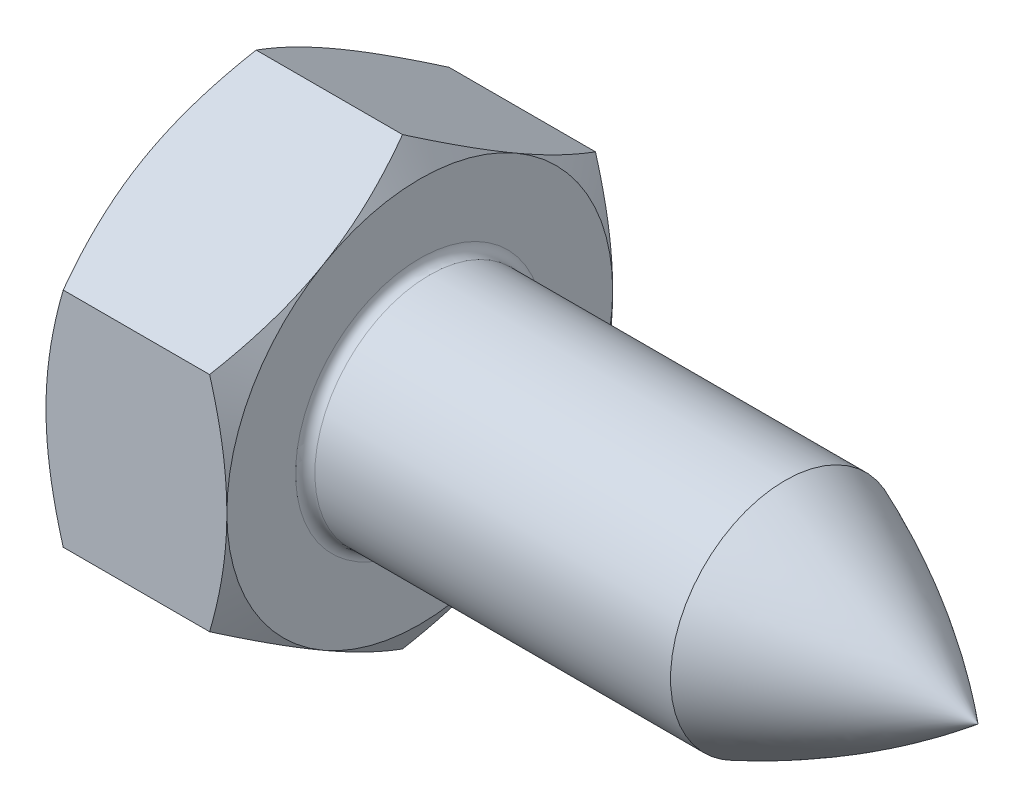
ISO-10303-21;
HEADER;
FILE_DESCRIPTION(('STEP AP214'),'2;1');
FILE_NAME('part.step','',(''),(''),'','','');
FILE_SCHEMA(('AUTOMOTIVE_DESIGN { 1 0 10303 214 1 1 1 1 }'));
ENDSEC;
DATA;
#1=APPLICATION_CONTEXT('core data for automotive mechanical design processes');
#2=APPLICATION_PROTOCOL_DEFINITION('international standard','automotive_design',2000,#1);
#3=PRODUCT_CONTEXT('',#1,'mechanical');
#4=PRODUCT('Part','Part','',(#3));
#5=PRODUCT_RELATED_PRODUCT_CATEGORY('part','',(#4));
#6=PRODUCT_DEFINITION_FORMATION('','',#4);
#7=PRODUCT_DEFINITION_CONTEXT('part definition',#1,'design');
#8=PRODUCT_DEFINITION('design','',#6,#7);
#9=PRODUCT_DEFINITION_SHAPE('','',#8);
#10=(LENGTH_UNIT() NAMED_UNIT(*) SI_UNIT(.MILLI.,.METRE.));
#11=(NAMED_UNIT(*) PLANE_ANGLE_UNIT() SI_UNIT($,.RADIAN.));
#12=(NAMED_UNIT(*) SI_UNIT($,.STERADIAN.) SOLID_ANGLE_UNIT());
#13=UNCERTAINTY_MEASURE_WITH_UNIT(LENGTH_MEASURE(1.E-05),#10,'distance_accuracy_value','');
#14=(GEOMETRIC_REPRESENTATION_CONTEXT(3) GLOBAL_UNCERTAINTY_ASSIGNED_CONTEXT((#13)) GLOBAL_UNIT_ASSIGNED_CONTEXT((#10,
#11,#12)) REPRESENTATION_CONTEXT('',''));
#15=CARTESIAN_POINT('',(0.,0.,0.));
#16=DIRECTION('',(0.,0.,1.));
#17=DIRECTION('',(1.,0.,0.));
#18=AXIS2_PLACEMENT_3D('',#15,#16,#17);
#19=CARTESIAN_POINT('',(-9.54447010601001,0.,0.));
#20=DIRECTION('',(-1.,0.,0.));
#21=DIRECTION('',(0.,0.,1.));
#22=AXIS2_PLACEMENT_3D('',#19,#20,#21);
#23=CYLINDRICAL_SURFACE('',#22,4.75);
#24=CARTESIAN_POINT('',(7.9,0.,0.));
#25=DIRECTION('',(1.,0.,0.));
#26=DIRECTION('',(0.,0.,-1.));
#27=AXIS2_PLACEMENT_3D('',#24,#25,#26);
#28=CIRCLE('',#27,4.75);
#29=CARTESIAN_POINT('',(7.9,0.,-4.75));
#30=VERTEX_POINT('',#29);
#31=EDGE_CURVE('E12',#30,#30,#28,.T.);
#32=ORIENTED_EDGE('',*,*,#31,.T.);
#33=EDGE_LOOP('',(#32));
#34=FACE_BOUND('',#33,.T.);
#35=CARTESIAN_POINT('',(22.65,0.,0.));
#36=DIRECTION('',(1.,0.,0.));
#37=DIRECTION('',(0.,1.,0.));
#38=AXIS2_PLACEMENT_3D('',#35,#36,#37);
#39=CIRCLE('',#38,4.75);
#40=CARTESIAN_POINT('',(22.65,4.75,0.));
#41=VERTEX_POINT('',#40);
#42=EDGE_CURVE('E755',#41,#41,#39,.T.);
#43=ORIENTED_EDGE('',*,*,#42,.F.);
#44=EDGE_LOOP('',(#43));
#45=FACE_BOUND('',#44,.T.);
#46=ADVANCED_FACE('F48',(#34,#45),#23,.T.);
#47=CARTESIAN_POINT('',(1.5,6.66666666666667,0.));
#48=DIRECTION('',(1.,0.,0.));
#49=DIRECTION('',(0.,0.,-1.));
#50=AXIS2_PLACEMENT_3D('',#47,#48,#49);
#51=PLANE('',#50);
#52=CARTESIAN_POINT('',(1.5,0.,0.));
#53=DIRECTION('',(1.,0.,0.));
#54=DIRECTION('',(0.,0.,-1.));
#55=AXIS2_PLACEMENT_3D('',#52,#53,#54);
#56=CIRCLE('',#55,6.66666666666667);
#57=CARTESIAN_POINT('',(1.5,0.,-6.66666666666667));
#58=VERTEX_POINT('',#57);
#59=EDGE_CURVE('E419',#58,#58,#56,.T.);
#60=ORIENTED_EDGE('',*,*,#59,.F.);
#61=EDGE_LOOP('',(#60));
#62=FACE_BOUND('',#61,.T.);
#63=DIRECTION('',(0.,-1.,0.));
#64=VECTOR('',#63,1.);
#65=CARTESIAN_POINT('',(1.5,0.72,-3.6));
#66=LINE('',#65,#64);
#67=CARTESIAN_POINT('',(1.5,0.72,-3.6));
#68=VERTEX_POINT('',#67);
#69=CARTESIAN_POINT('',(1.5,-0.72,-3.6));
#70=VERTEX_POINT('',#69);
#71=EDGE_CURVE('E433',#68,#70,#66,.T.);
#72=ORIENTED_EDGE('',*,*,#71,.F.);
#73=DIRECTION('',(0.,0.,-1.));
#74=VECTOR('',#73,1.);
#75=CARTESIAN_POINT('',(1.5,0.72,-0.72));
#76=LINE('',#75,#74);
#77=CARTESIAN_POINT('',(1.5,0.72,-0.72));
#78=VERTEX_POINT('',#77);
#79=EDGE_CURVE('E435',#78,#68,#76,.T.);
#80=ORIENTED_EDGE('',*,*,#79,.F.);
#81=DIRECTION('',(0.,-1.,0.));
#82=VECTOR('',#81,1.);
#83=CARTESIAN_POINT('',(1.5,3.6,-0.72));
#84=LINE('',#83,#82);
#85=CARTESIAN_POINT('',(1.5,3.6,-0.72));
#86=VERTEX_POINT('',#85);
#87=EDGE_CURVE('E802',#86,#78,#84,.T.);
#88=ORIENTED_EDGE('',*,*,#87,.F.);
#89=DIRECTION('',(0.,0.,-1.));
#90=VECTOR('',#89,1.);
#91=CARTESIAN_POINT('',(1.5,3.6,0.72));
#92=LINE('',#91,#90);
#93=CARTESIAN_POINT('',(1.5,3.6,0.72));
#94=VERTEX_POINT('',#93);
#95=EDGE_CURVE('E805',#94,#86,#92,.T.);
#96=ORIENTED_EDGE('',*,*,#95,.F.);
#97=DIRECTION('',(0.,1.,0.));
#98=VECTOR('',#97,1.);
#99=CARTESIAN_POINT('',(1.5,3.6,0.72));
#100=LINE('',#99,#98);
#101=CARTESIAN_POINT('',(1.5,0.72,0.72));
#102=VERTEX_POINT('',#101);
#103=EDGE_CURVE('E808',#102,#94,#100,.T.);
#104=ORIENTED_EDGE('',*,*,#103,.F.);
#105=DIRECTION('',(0.,0.,-1.));
#106=VECTOR('',#105,1.);
#107=CARTESIAN_POINT('',(1.5,0.72,0.72));
#108=LINE('',#107,#106);
#109=CARTESIAN_POINT('',(1.5,0.72,3.6));
#110=VERTEX_POINT('',#109);
#111=EDGE_CURVE('E818',#110,#102,#108,.T.);
#112=ORIENTED_EDGE('',*,*,#111,.F.);
#113=DIRECTION('',(0.,1.,0.));
#114=VECTOR('',#113,1.);
#115=CARTESIAN_POINT('',(1.5,0.72,3.6));
#116=LINE('',#115,#114);
#117=CARTESIAN_POINT('',(1.5,-0.720000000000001,3.6));
#118=VERTEX_POINT('',#117);
#119=EDGE_CURVE('E822',#118,#110,#116,.T.);
#120=ORIENTED_EDGE('',*,*,#119,.F.);
#121=DIRECTION('',(0.,0.,1.));
#122=VECTOR('',#121,1.);
#123=CARTESIAN_POINT('',(1.5,-0.72,0.72));
#124=LINE('',#123,#122);
#125=CARTESIAN_POINT('',(1.5,-0.72,0.72));
#126=VERTEX_POINT('',#125);
#127=EDGE_CURVE('E425',#126,#118,#124,.T.);
#128=ORIENTED_EDGE('',*,*,#127,.F.);
#129=DIRECTION('',(0.,1.,0.));
#130=VECTOR('',#129,1.);
#131=CARTESIAN_POINT('',(1.5,-3.6,0.72));
#132=LINE('',#131,#130);
#133=CARTESIAN_POINT('',(1.5,-3.6,0.72));
#134=VERTEX_POINT('',#133);
#135=EDGE_CURVE('E422',#134,#126,#132,.T.);
#136=ORIENTED_EDGE('',*,*,#135,.F.);
#137=DIRECTION('',(0.,0.,1.));
#138=VECTOR('',#137,1.);
#139=CARTESIAN_POINT('',(1.5,-3.6,0.72));
#140=LINE('',#139,#138);
#141=CARTESIAN_POINT('',(1.5,-3.6,-0.72));
#142=VERTEX_POINT('',#141);
#143=EDGE_CURVE('E761',#142,#134,#140,.T.);
#144=ORIENTED_EDGE('',*,*,#143,.F.);
#145=DIRECTION('',(0.,-1.,0.));
#146=VECTOR('',#145,1.);
#147=CARTESIAN_POINT('',(1.5,-3.6,-0.72));
#148=LINE('',#147,#146);
#149=CARTESIAN_POINT('',(1.5,-0.72,-0.72));
#150=VERTEX_POINT('',#149);
#151=EDGE_CURVE('E797',#150,#142,#148,.T.);
#152=ORIENTED_EDGE('',*,*,#151,.F.);
#153=DIRECTION('',(0.,0.,1.));
#154=VECTOR('',#153,1.);
#155=CARTESIAN_POINT('',(1.5,-0.72,-0.72));
#156=LINE('',#155,#154);
#157=EDGE_CURVE('E436',#70,#150,#156,.T.);
#158=ORIENTED_EDGE('',*,*,#157,.F.);
#159=EDGE_LOOP('',(#72,#80,#88,#96,#104,#112,#120,#128,#136,#144,#152,#158));
#160=FACE_BOUND('',#159,.T.);
#161=ADVANCED_FACE('F190',(#62,#160),#51,.F.);
#162=CARTESIAN_POINT('',(7.5,13.856406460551,8.));
#163=DIRECTION('',(1.,0.,0.));
#164=DIRECTION('',(0.,0.,-1.));
#165=AXIS2_PLACEMENT_3D('',#162,#163,#164);
#166=PLANE('',#165);
#167=CARTESIAN_POINT('',(7.5,0.,0.));
#168=DIRECTION('',(1.,0.,0.));
#169=DIRECTION('',(0.,0.,-1.));
#170=AXIS2_PLACEMENT_3D('',#167,#168,#169);
#171=CIRCLE('',#170,5.15);
#172=CARTESIAN_POINT('',(7.5,0.,-5.15));
#173=VERTEX_POINT('',#172);
#174=EDGE_CURVE('E56',#173,#173,#171,.F.);
#175=ORIENTED_EDGE('',*,*,#174,.T.);
#176=EDGE_LOOP('',(#175));
#177=FACE_BOUND('',#176,.T.);
#178=CARTESIAN_POINT('',(7.5,0.,0.));
#179=DIRECTION('',(1.,0.,0.));
#180=DIRECTION('',(0.,1.,0.));
#181=AXIS2_PLACEMENT_3D('',#178,#179,#180);
#182=CIRCLE('',#181,8.);
#183=CARTESIAN_POINT('',(7.5,-6.92820323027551,-4.));
#184=VERTEX_POINT('',#183);
#185=CARTESIAN_POINT('',(7.5,0.,-8.));
#186=VERTEX_POINT('',#185);
#187=EDGE_CURVE('E417',#184,#186,#182,.T.);
#188=ORIENTED_EDGE('',*,*,#187,.T.);
#189=CARTESIAN_POINT('',(7.5,6.92820323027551,-4.));
#190=VERTEX_POINT('',#189);
#191=EDGE_CURVE('E414',#186,#190,#182,.T.);
#192=ORIENTED_EDGE('',*,*,#191,.T.);
#193=CARTESIAN_POINT('',(7.5,6.92820323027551,4.));
#194=VERTEX_POINT('',#193);
#195=EDGE_CURVE('E409',#190,#194,#182,.T.);
#196=ORIENTED_EDGE('',*,*,#195,.T.);
#197=CARTESIAN_POINT('',(7.5,0.,8.));
#198=VERTEX_POINT('',#197);
#199=EDGE_CURVE('E71',#194,#198,#182,.T.);
#200=ORIENTED_EDGE('',*,*,#199,.T.);
#201=CARTESIAN_POINT('',(7.5,-6.92820323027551,4.));
#202=VERTEX_POINT('',#201);
#203=EDGE_CURVE('E408',#198,#202,#182,.T.);
#204=ORIENTED_EDGE('',*,*,#203,.T.);
#205=EDGE_CURVE('E412',#202,#184,#182,.T.);
#206=ORIENTED_EDGE('',*,*,#205,.T.);
#207=EDGE_LOOP('',(#188,#192,#196,#200,#204,#206));
#208=FACE_BOUND('',#207,.T.);
#209=ADVANCED_FACE('F196',(#177,#208),#166,.T.);
#210=CARTESIAN_POINT('',(6.78546882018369,0.,0.));
#211=DIRECTION('',(-1.,0.,0.));
#212=DIRECTION('',(0.,-1.,0.));
#213=AXIS2_PLACEMENT_3D('',#210,#211,#212);
#214=CONICAL_SURFACE('',#213,9.23760430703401,1.0471975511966);
#215=CARTESIAN_POINT('',(3.67178635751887,-12.2497439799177,-8.));
#216=CARTESIAN_POINT('',(3.84152745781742,-11.8984987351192,-8.));
#217=CARTESIAN_POINT('',(4.00958119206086,-11.5464230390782,-8.));
#218=CARTESIAN_POINT('',(4.34134970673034,-10.8401616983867,-8.));
#219=CARTESIAN_POINT('',(4.5050637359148,-10.4859757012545,-8.));
#220=CARTESIAN_POINT('',(4.82805107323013,-9.7731314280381,-8.));
#221=CARTESIAN_POINT('',(4.98729360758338,-9.41445915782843,-8.));
#222=CARTESIAN_POINT('',(5.29893883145,-8.69416671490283,-8.));
#223=CARTESIAN_POINT('',(5.45134187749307,-8.33254669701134,-8.));
#224=CARTESIAN_POINT('',(5.74929869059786,-7.60129405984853,-8.));
#225=CARTESIAN_POINT('',(5.89474539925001,-7.23161757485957,-8.));
#226=CARTESIAN_POINT('',(6.1742475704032,-6.48790521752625,-8.));
#227=CARTESIAN_POINT('',(6.3083017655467,-6.11386886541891,-8.));
#228=CARTESIAN_POINT('',(6.56141638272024,-5.36160531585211,-8.));
#229=CARTESIAN_POINT('',(6.68050868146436,-4.98338896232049,-8.));
#230=CARTESIAN_POINT('',(6.89983373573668,-4.22159300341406,-8.));
#231=CARTESIAN_POINT('',(7.00007245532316,-3.83801513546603,-8.));
#232=CARTESIAN_POINT('',(7.17681673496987,-3.06517005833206,-8.));
#233=CARTESIAN_POINT('',(7.25331597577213,-2.67590136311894,-8.));
#234=CARTESIAN_POINT('',(7.34642984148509,-2.0885729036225,-8.));
#235=CARTESIAN_POINT('',(7.37386398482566,-1.89220175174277,-8.));
#236=CARTESIAN_POINT('',(7.42098081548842,-1.49853877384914,-8.));
#237=CARTESIAN_POINT('',(7.44066427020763,-1.30124704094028,-8.));
#238=CARTESIAN_POINT('',(7.47175001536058,-0.907261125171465,-8.));
#239=CARTESIAN_POINT('',(7.48320372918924,-0.710571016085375,-8.));
#240=CARTESIAN_POINT('',(7.49776943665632,-0.316882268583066,-8.));
#241=CARTESIAN_POINT('',(7.50088153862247,-0.11988363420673,-8.));
#242=CARTESIAN_POINT('',(7.49868986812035,0.274012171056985,-8.));
#243=CARTESIAN_POINT('',(7.49338845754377,0.47090935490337,-8.));
#244=CARTESIAN_POINT('',(7.47450159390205,0.864308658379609,-8.));
#245=CARTESIAN_POINT('',(7.46091572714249,1.06081075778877,-8.));
#246=CARTESIAN_POINT('',(7.41823147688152,1.53707134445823,-8.));
#247=CARTESIAN_POINT('',(7.38498228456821,1.81646391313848,-8.));
#248=CARTESIAN_POINT('',(7.30358169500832,2.37310809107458,-8.));
#249=CARTESIAN_POINT('',(7.25542623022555,2.6503590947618,-8.));
#250=CARTESIAN_POINT('',(7.14592101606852,3.20249141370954,-8.));
#251=CARTESIAN_POINT('',(7.08455879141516,3.47737023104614,-8.));
#252=CARTESIAN_POINT('',(6.95051229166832,4.02429975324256,-8.));
#253=CARTESIAN_POINT('',(6.87782908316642,4.29635072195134,-8.));
#254=CARTESIAN_POINT('',(6.72097954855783,4.84432510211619,-8.));
#255=CARTESIAN_POINT('',(6.63657541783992,5.12017997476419,-8.));
#256=CARTESIAN_POINT('',(6.4594275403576,5.6689739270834,-8.));
#257=CARTESIAN_POINT('',(6.36668954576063,5.94191487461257,-8.));
#258=CARTESIAN_POINT('',(6.17478953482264,6.48378576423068,-8.));
#259=CARTESIAN_POINT('',(6.07566661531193,6.75272963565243,-8.));
#260=CARTESIAN_POINT('',(5.87160282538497,7.2885307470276,-8.));
#261=CARTESIAN_POINT('',(5.76665960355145,7.55538709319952,-8.));
#262=CARTESIAN_POINT('',(5.65938198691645,7.82127397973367,-8.));
#263=B_SPLINE_CURVE_WITH_KNOTS('',3,(#215,#216,#217,#218,#219,#220,#221,#222,#223,#224,#225,
#226,#227,#228,#229,#230,#231,#232,#233,#234,#235,#236,#237,#238,#239,#240,#241,#242,#243,#244,
#245,#246,#247,#248,#249,#250,#251,#252,#253,#254,#255,#256,#257,#258,#259,#260,#261,#262),
.UNSPECIFIED.,.F.,.F.,(4,2,2,2,2,2,2,2,2,2,2,2,2,2,2,2,2,2,2,2,2,2,2,4),(0.,1.17034358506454,
2.3408884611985,3.51813189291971,4.69531388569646,5.88694801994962,7.07871454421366,
8.26789729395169,9.45670322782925,10.6458253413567,11.2405311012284,11.8351779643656,
12.4260760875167,13.0169665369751,13.6076911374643,14.1984452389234,15.0420672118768,
15.8859195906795,16.7305726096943,17.5751460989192,18.4404219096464,19.305105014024,
20.1649211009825,21.0250871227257),.UNSPECIFIED.);
#264=CARTESIAN_POINT('',(6.78546882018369,-4.61880215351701,-8.));
#265=VERTEX_POINT('',#264);
#266=EDGE_CURVE('E233',#186,#265,#263,.F.);
#267=ORIENTED_EDGE('',*,*,#266,.F.);
#268=ORIENTED_EDGE('',*,*,#187,.F.);
#269=CARTESIAN_POINT('',(6.78540215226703,-4.61868668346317,-8.0002));
#270=CARTESIAN_POINT('',(6.84400928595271,-4.7202130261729,-7.8243512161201));
#271=CARTESIAN_POINT('',(6.89995659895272,-4.82211789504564,-7.64784680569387));
#272=CARTESIAN_POINT('',(7.00579899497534,-5.02675523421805,-7.29340453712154));
#273=CARTESIAN_POINT('',(7.05569146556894,-5.12948804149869,-7.11546609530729));
#274=CARTESIAN_POINT('',(7.19530720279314,-5.43933133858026,-6.57880176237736));
#275=CARTESIAN_POINT('',(7.27471882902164,-5.64766491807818,-6.21795741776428));
#276=CARTESIAN_POINT('',(7.36783835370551,-5.95943209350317,-5.67796082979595));
#277=CARTESIAN_POINT('',(7.39436541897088,-6.06193429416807,-5.50042181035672));
#278=CARTESIAN_POINT('',(7.43884682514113,-6.26740224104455,-5.1445408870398));
#279=CARTESIAN_POINT('',(7.45680192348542,-6.37036794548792,-4.96619905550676));
#280=CARTESIAN_POINT('',(7.48368435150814,-6.57647664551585,-4.60920831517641));
#281=CARTESIAN_POINT('',(7.49262192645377,-6.67961930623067,-4.4305599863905));
#282=CARTESIAN_POINT('',(7.50127769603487,-6.88599991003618,-4.07309829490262));
#283=CARTESIAN_POINT('',(7.50099617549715,-6.98923785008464,-3.89428493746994));
#284=CARTESIAN_POINT('',(7.49185497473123,-7.18224506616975,-3.5599866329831));
#285=CARTESIAN_POINT('',(7.48411039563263,-7.27202796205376,-3.40447809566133));
#286=CARTESIAN_POINT('',(7.46179886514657,-7.45138347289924,-3.09382523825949));
#287=CARTESIAN_POINT('',(7.44723145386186,-7.5409560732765,-2.93868094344));
#288=CARTESIAN_POINT('',(7.39363930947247,-7.80932710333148,-2.47384868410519));
#289=CARTESIAN_POINT('',(7.34473135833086,-7.98765049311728,-2.16498351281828));
#290=CARTESIAN_POINT('',(7.22246059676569,-8.34618890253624,-1.5439767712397));
#291=CARTESIAN_POINT('',(7.14857947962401,-8.52635816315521,-1.23191445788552));
#292=CARTESIAN_POINT('',(6.98089985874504,-8.88400987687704,-0.612443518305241));
#293=CARTESIAN_POINT('',(6.88714073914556,-9.06149691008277,-0.305026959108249));
#294=CARTESIAN_POINT('',(6.78540215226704,-9.23771977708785,0.000200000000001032));
#295=B_SPLINE_CURVE_WITH_KNOTS('',3,(#269,#270,#271,#272,#273,#274,#275,#276,#277,#278,#279,
#280,#281,#282,#283,#284,#285,#286,#287,#288,#289,#290,#291,#292,#293,#294),.UNSPECIFIED.,.F.,
.F.,(4,2,2,2,2,2,2,2,2,2,2,2,4),(0.,0.633973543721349,1.26821965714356,2.53934712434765,
3.15934343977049,3.77928496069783,4.39852133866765,5.01773858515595,5.55680239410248,
6.09590254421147,7.17487077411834,8.27776850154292,9.37850115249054),.UNSPECIFIED.);
#296=EDGE_CURVE('E260',#265,#184,#295,.T.);
#297=ORIENTED_EDGE('',*,*,#296,.F.);
#298=EDGE_LOOP('',(#267,#268,#297));
#299=FACE_BOUND('',#298,.T.);
#300=ADVANCED_FACE('F207',(#299),#214,.T.);
#301=ORIENTED_EDGE('',*,*,#191,.F.);
#302=CARTESIAN_POINT('',(6.78546882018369,4.618802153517,-8.));
#303=VERTEX_POINT('',#302);
#304=EDGE_CURVE('E240',#303,#186,#263,.F.);
#305=ORIENTED_EDGE('',*,*,#304,.F.);
#306=CARTESIAN_POINT('',(6.78540215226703,9.23771977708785,0.000200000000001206));
#307=CARTESIAN_POINT('',(6.84400928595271,9.13619343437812,-0.175648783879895));
#308=CARTESIAN_POINT('',(6.89995659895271,9.03428856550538,-0.352153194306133));
#309=CARTESIAN_POINT('',(7.00579899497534,8.82965122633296,-0.706595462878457));
#310=CARTESIAN_POINT('',(7.05569146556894,8.72691841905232,-0.884533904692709));
#311=CARTESIAN_POINT('',(7.19530720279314,8.41707512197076,-1.42119823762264));
#312=CARTESIAN_POINT('',(7.27471882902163,8.20874154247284,-1.78204258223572));
#313=CARTESIAN_POINT('',(7.36783835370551,7.89697436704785,-2.32203917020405));
#314=CARTESIAN_POINT('',(7.39436541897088,7.79447216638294,-2.49957818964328));
#315=CARTESIAN_POINT('',(7.43884682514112,7.58900421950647,-2.8554591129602));
#316=CARTESIAN_POINT('',(7.45680192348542,7.4860385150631,-3.03380094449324));
#317=CARTESIAN_POINT('',(7.48368435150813,7.27992981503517,-3.39079168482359));
#318=CARTESIAN_POINT('',(7.49262192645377,7.17678715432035,-3.5694400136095));
#319=CARTESIAN_POINT('',(7.50127769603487,6.97040655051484,-3.92690170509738));
#320=CARTESIAN_POINT('',(7.50099617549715,6.86716861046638,-4.10571506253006));
#321=CARTESIAN_POINT('',(7.49185497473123,6.67416139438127,-4.4400133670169));
#322=CARTESIAN_POINT('',(7.48411039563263,6.58437849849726,-4.59552190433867));
#323=CARTESIAN_POINT('',(7.46179886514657,6.40502298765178,-4.90617476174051));
#324=CARTESIAN_POINT('',(7.44723145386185,6.31545038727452,-5.06131905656));
#325=CARTESIAN_POINT('',(7.39363930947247,6.04707935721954,-5.52615131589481));
#326=CARTESIAN_POINT('',(7.34473135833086,5.86875596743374,-5.83501648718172));
#327=CARTESIAN_POINT('',(7.22246059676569,5.51021755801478,-6.4560232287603));
#328=CARTESIAN_POINT('',(7.14857947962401,5.3300482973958,-6.76808554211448));
#329=CARTESIAN_POINT('',(6.98089985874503,4.97239658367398,-7.38755648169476));
#330=CARTESIAN_POINT('',(6.88714073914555,4.79490955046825,-7.69497304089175));
#331=CARTESIAN_POINT('',(6.78540215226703,4.61868668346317,-8.0002));
#332=B_SPLINE_CURVE_WITH_KNOTS('',3,(#306,#307,#308,#309,#310,#311,#312,#313,#314,#315,#316,
#317,#318,#319,#320,#321,#322,#323,#324,#325,#326,#327,#328,#329,#330,#331),.UNSPECIFIED.,.F.,
.F.,(4,2,2,2,2,2,2,2,2,2,2,2,4),(0.,0.633973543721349,1.26821965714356,2.53934712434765,
3.15934343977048,3.77928496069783,4.39852133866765,5.01773858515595,5.55680239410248,
6.09590254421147,7.17487077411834,8.27776850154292,9.37850115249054),.UNSPECIFIED.);
#333=EDGE_CURVE('E267',#190,#303,#332,.T.);
#334=ORIENTED_EDGE('',*,*,#333,.F.);
#335=EDGE_LOOP('',(#301,#305,#334));
#336=FACE_BOUND('',#335,.T.);
#337=ADVANCED_FACE('F689',(#336),#214,.T.);
#338=CARTESIAN_POINT('',(6.78546882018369,-9.23760430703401,0.));
#339=VERTEX_POINT('',#338);
#340=EDGE_CURVE('E392',#184,#339,#295,.T.);
#341=ORIENTED_EDGE('',*,*,#340,.F.);
#342=ORIENTED_EDGE('',*,*,#205,.F.);
#343=CARTESIAN_POINT('',(6.78540215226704,-9.23771977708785,-0.000199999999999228));
#344=CARTESIAN_POINT('',(6.84400928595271,-9.13619343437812,0.175648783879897));
#345=CARTESIAN_POINT('',(6.89995659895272,-9.03428856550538,0.352153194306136));
#346=CARTESIAN_POINT('',(7.00579899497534,-8.82965122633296,0.706595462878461));
#347=CARTESIAN_POINT('',(7.05569146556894,-8.72691841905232,0.884533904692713));
#348=CARTESIAN_POINT('',(7.19530720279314,-8.41707512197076,1.42119823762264));
#349=CARTESIAN_POINT('',(7.27471882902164,-8.20874154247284,1.78204258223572));
#350=CARTESIAN_POINT('',(7.36783835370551,-7.89697436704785,2.32203917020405));
#351=CARTESIAN_POINT('',(7.39436541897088,-7.79447216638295,2.49957818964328));
#352=CARTESIAN_POINT('',(7.43884682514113,-7.58900421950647,2.8554591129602));
#353=CARTESIAN_POINT('',(7.45680192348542,-7.4860385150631,3.03380094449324));
#354=CARTESIAN_POINT('',(7.48368435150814,-7.27992981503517,3.39079168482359));
#355=CARTESIAN_POINT('',(7.49262192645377,-7.17678715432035,3.5694400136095));
#356=CARTESIAN_POINT('',(7.50127769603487,-6.97040655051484,3.92690170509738));
#357=CARTESIAN_POINT('',(7.50099617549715,-6.86716861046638,4.10571506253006));
#358=CARTESIAN_POINT('',(7.49185497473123,-6.67416139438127,4.4400133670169));
#359=CARTESIAN_POINT('',(7.48411039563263,-6.58437849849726,4.59552190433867));
#360=CARTESIAN_POINT('',(7.46179886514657,-6.40502298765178,4.90617476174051));
#361=CARTESIAN_POINT('',(7.44723145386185,-6.31545038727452,5.06131905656));
#362=CARTESIAN_POINT('',(7.39363930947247,-6.04707935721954,5.52615131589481));
#363=CARTESIAN_POINT('',(7.34473135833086,-5.86875596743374,5.83501648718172));
#364=CARTESIAN_POINT('',(7.22246059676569,-5.51021755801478,6.4560232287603));
#365=CARTESIAN_POINT('',(7.14857947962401,-5.33004829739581,6.76808554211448));
#366=CARTESIAN_POINT('',(6.98089985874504,-4.97239658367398,7.38755648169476));
#367=CARTESIAN_POINT('',(6.88714073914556,-4.79490955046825,7.69497304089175));
#368=CARTESIAN_POINT('',(6.78540215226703,-4.61868668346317,8.0002));
#369=B_SPLINE_CURVE_WITH_KNOTS('',3,(#343,#344,#345,#346,#347,#348,#349,#350,#351,#352,#353,
#354,#355,#356,#357,#358,#359,#360,#361,#362,#363,#364,#365,#366,#367,#368),.UNSPECIFIED.,.F.,
.F.,(4,2,2,2,2,2,2,2,2,2,2,2,4),(0.,0.63397354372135,1.26821965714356,2.53934712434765,
3.15934343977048,3.77928496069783,4.39852133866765,5.01773858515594,5.55680239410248,
6.09590254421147,7.17487077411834,8.27776850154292,9.37850115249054),.UNSPECIFIED.);
#370=EDGE_CURVE('E272',#339,#202,#369,.T.);
#371=ORIENTED_EDGE('',*,*,#370,.F.);
#372=EDGE_LOOP('',(#341,#342,#371));
#373=FACE_BOUND('',#372,.T.);
#374=ADVANCED_FACE('F250',(#373),#214,.T.);
#375=CARTESIAN_POINT('',(6.78546882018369,-4.61880215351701,7.99999999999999));
#376=VERTEX_POINT('',#375);
#377=EDGE_CURVE('E402',#202,#376,#369,.T.);
#378=ORIENTED_EDGE('',*,*,#377,.F.);
#379=ORIENTED_EDGE('',*,*,#203,.F.);
#380=CARTESIAN_POINT('',(3.67178635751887,-12.2497439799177,8.));
#381=CARTESIAN_POINT('',(3.84152745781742,-11.8984987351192,8.));
#382=CARTESIAN_POINT('',(4.00958119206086,-11.5464230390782,8.));
#383=CARTESIAN_POINT('',(4.34134970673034,-10.8401616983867,8.));
#384=CARTESIAN_POINT('',(4.5050637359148,-10.4859757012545,8.));
#385=CARTESIAN_POINT('',(4.82805107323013,-9.7731314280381,8.));
#386=CARTESIAN_POINT('',(4.98729360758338,-9.41445915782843,8.));
#387=CARTESIAN_POINT('',(5.29893883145,-8.69416671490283,8.));
#388=CARTESIAN_POINT('',(5.45134187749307,-8.33254669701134,8.));
#389=CARTESIAN_POINT('',(5.74929869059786,-7.60129405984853,8.));
#390=CARTESIAN_POINT('',(5.89474539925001,-7.23161757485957,8.));
#391=CARTESIAN_POINT('',(6.1742475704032,-6.48790521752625,8.));
#392=CARTESIAN_POINT('',(6.3083017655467,-6.11386886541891,8.));
#393=CARTESIAN_POINT('',(6.56141638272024,-5.36160531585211,8.));
#394=CARTESIAN_POINT('',(6.68050868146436,-4.98338896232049,8.));
#395=CARTESIAN_POINT('',(6.89983373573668,-4.22159300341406,8.));
#396=CARTESIAN_POINT('',(7.00007245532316,-3.83801513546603,8.));
#397=CARTESIAN_POINT('',(7.17681673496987,-3.06517005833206,8.));
#398=CARTESIAN_POINT('',(7.25331597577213,-2.67590136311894,8.));
#399=CARTESIAN_POINT('',(7.34642984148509,-2.0885729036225,8.));
#400=CARTESIAN_POINT('',(7.37386398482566,-1.89220175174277,8.));
#401=CARTESIAN_POINT('',(7.42098081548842,-1.49853877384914,8.));
#402=CARTESIAN_POINT('',(7.44066427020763,-1.30124704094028,8.));
#403=CARTESIAN_POINT('',(7.47175001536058,-0.907261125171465,8.));
#404=CARTESIAN_POINT('',(7.48320372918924,-0.710571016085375,8.));
#405=CARTESIAN_POINT('',(7.49776943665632,-0.316882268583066,8.));
#406=CARTESIAN_POINT('',(7.50088153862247,-0.11988363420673,8.));
#407=CARTESIAN_POINT('',(7.49868986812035,0.274012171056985,8.));
#408=CARTESIAN_POINT('',(7.49338845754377,0.47090935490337,8.));
#409=CARTESIAN_POINT('',(7.47450159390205,0.864308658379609,8.));
#410=CARTESIAN_POINT('',(7.46091572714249,1.06081075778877,8.));
#411=CARTESIAN_POINT('',(7.41823147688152,1.53707134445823,8.));
#412=CARTESIAN_POINT('',(7.38498228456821,1.81646391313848,8.));
#413=CARTESIAN_POINT('',(7.30358169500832,2.37310809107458,8.));
#414=CARTESIAN_POINT('',(7.25542623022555,2.6503590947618,8.));
#415=CARTESIAN_POINT('',(7.14592101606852,3.20249141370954,8.));
#416=CARTESIAN_POINT('',(7.08455879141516,3.47737023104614,8.));
#417=CARTESIAN_POINT('',(6.95051229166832,4.02429975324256,8.));
#418=CARTESIAN_POINT('',(6.87782908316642,4.29635072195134,8.));
#419=CARTESIAN_POINT('',(6.72097954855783,4.84432510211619,8.));
#420=CARTESIAN_POINT('',(6.63657541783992,5.12017997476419,8.));
#421=CARTESIAN_POINT('',(6.4594275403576,5.6689739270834,8.));
#422=CARTESIAN_POINT('',(6.36668954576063,5.94191487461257,8.));
#423=CARTESIAN_POINT('',(6.17478953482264,6.48378576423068,8.));
#424=CARTESIAN_POINT('',(6.07566661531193,6.75272963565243,8.));
#425=CARTESIAN_POINT('',(5.87160282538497,7.2885307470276,8.));
#426=CARTESIAN_POINT('',(5.76665960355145,7.55538709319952,8.));
#427=CARTESIAN_POINT('',(5.65938198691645,7.82127397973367,8.));
#428=B_SPLINE_CURVE_WITH_KNOTS('',3,(#380,#381,#382,#383,#384,#385,#386,#387,#388,#389,#390,
#391,#392,#393,#394,#395,#396,#397,#398,#399,#400,#401,#402,#403,#404,#405,#406,#407,#408,#409,
#410,#411,#412,#413,#414,#415,#416,#417,#418,#419,#420,#421,#422,#423,#424,#425,#426,#427),
.UNSPECIFIED.,.F.,.F.,(4,2,2,2,2,2,2,2,2,2,2,2,2,2,2,2,2,2,2,2,2,2,2,4),(0.,1.17034358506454,
2.3408884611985,3.51813189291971,4.69531388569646,5.88694801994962,7.07871454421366,
8.26789729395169,9.45670322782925,10.6458253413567,11.2405311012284,11.8351779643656,
12.4260760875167,13.0169665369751,13.6076911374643,14.1984452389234,15.0420672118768,
15.8859195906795,16.7305726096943,17.5751460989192,18.4404219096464,19.305105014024,
20.1649211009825,21.0250871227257),.UNSPECIFIED.);
#429=EDGE_CURVE('E400',#376,#198,#428,.T.);
#430=ORIENTED_EDGE('',*,*,#429,.F.);
#431=EDGE_LOOP('',(#378,#379,#430));
#432=FACE_BOUND('',#431,.T.);
#433=ADVANCED_FACE('F246',(#432),#214,.T.);
#434=ORIENTED_EDGE('',*,*,#199,.F.);
#435=CARTESIAN_POINT('',(6.78540215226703,4.61868668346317,8.0002));
#436=CARTESIAN_POINT('',(6.84400928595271,4.72021302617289,7.8243512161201));
#437=CARTESIAN_POINT('',(6.89995659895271,4.82211789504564,7.64784680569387));
#438=CARTESIAN_POINT('',(7.00579899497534,5.02675523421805,7.29340453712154));
#439=CARTESIAN_POINT('',(7.05569146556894,5.12948804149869,7.11546609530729));
#440=CARTESIAN_POINT('',(7.19530720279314,5.43933133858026,6.57880176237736));
#441=CARTESIAN_POINT('',(7.27471882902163,5.64766491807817,6.21795741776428));
#442=CARTESIAN_POINT('',(7.36783835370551,5.95943209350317,5.67796082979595));
#443=CARTESIAN_POINT('',(7.39436541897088,6.06193429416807,5.50042181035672));
#444=CARTESIAN_POINT('',(7.43884682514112,6.26740224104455,5.1445408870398));
#445=CARTESIAN_POINT('',(7.45680192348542,6.37036794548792,4.96619905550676));
#446=CARTESIAN_POINT('',(7.48368435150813,6.57647664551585,4.60920831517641));
#447=CARTESIAN_POINT('',(7.49262192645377,6.67961930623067,4.4305599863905));
#448=CARTESIAN_POINT('',(7.50127769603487,6.88599991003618,4.07309829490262));
#449=CARTESIAN_POINT('',(7.50099617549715,6.98923785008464,3.89428493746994));
#450=CARTESIAN_POINT('',(7.49185497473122,7.18224506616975,3.5599866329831));
#451=CARTESIAN_POINT('',(7.48411039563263,7.27202796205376,3.40447809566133));
#452=CARTESIAN_POINT('',(7.46179886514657,7.45138347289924,3.09382523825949));
#453=CARTESIAN_POINT('',(7.44723145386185,7.5409560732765,2.93868094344));
#454=CARTESIAN_POINT('',(7.39363930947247,7.80932710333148,2.47384868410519));
#455=CARTESIAN_POINT('',(7.34473135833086,7.98765049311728,2.16498351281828));
#456=CARTESIAN_POINT('',(7.22246059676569,8.34618890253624,1.5439767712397));
#457=CARTESIAN_POINT('',(7.14857947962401,8.52635816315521,1.23191445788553));
#458=CARTESIAN_POINT('',(6.98089985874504,8.88400987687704,0.612443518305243));
#459=CARTESIAN_POINT('',(6.88714073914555,9.06149691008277,0.30502695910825));
#460=CARTESIAN_POINT('',(6.78540215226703,9.23771977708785,-0.000199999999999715));
#461=B_SPLINE_CURVE_WITH_KNOTS('',3,(#435,#436,#437,#438,#439,#440,#441,#442,#443,#444,#445,
#446,#447,#448,#449,#450,#451,#452,#453,#454,#455,#456,#457,#458,#459,#460),.UNSPECIFIED.,.F.,
.F.,(4,2,2,2,2,2,2,2,2,2,2,2,4),(0.,0.633973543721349,1.26821965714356,2.53934712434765,
3.15934343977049,3.77928496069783,4.39852133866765,5.01773858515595,5.55680239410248,
6.09590254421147,7.17487077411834,8.27776850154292,9.37850115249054),.UNSPECIFIED.);
#462=CARTESIAN_POINT('',(6.78546882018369,4.618802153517,8.));
#463=VERTEX_POINT('',#462);
#464=EDGE_CURVE('E283',#463,#194,#461,.T.);
#465=ORIENTED_EDGE('',*,*,#464,.F.);
#466=EDGE_CURVE('E284',#198,#463,#428,.T.);
#467=ORIENTED_EDGE('',*,*,#466,.F.);
#468=EDGE_LOOP('',(#434,#465,#467));
#469=FACE_BOUND('',#468,.T.);
#470=ADVANCED_FACE('F249',(#469),#214,.T.);
#471=ORIENTED_EDGE('',*,*,#195,.F.);
#472=CARTESIAN_POINT('',(6.78546882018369,9.23760430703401,0.));
#473=VERTEX_POINT('',#472);
#474=EDGE_CURVE('E405',#473,#190,#332,.T.);
#475=ORIENTED_EDGE('',*,*,#474,.F.);
#476=EDGE_CURVE('E277',#194,#473,#461,.T.);
#477=ORIENTED_EDGE('',*,*,#476,.F.);
#478=EDGE_LOOP('',(#471,#475,#477));
#479=FACE_BOUND('',#478,.T.);
#480=ADVANCED_FACE('F213',(#479),#214,.T.);
#481=CARTESIAN_POINT('',(0.,13.856406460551,8.));
#482=DIRECTION('',(1.,0.,0.));
#483=DIRECTION('',(0.,0.,-1.));
#484=AXIS2_PLACEMENT_3D('',#481,#482,#483);
#485=PLANE('',#484);
#486=CARTESIAN_POINT('',(0.,0.,0.));
#487=DIRECTION('',(1.,0.,0.));
#488=DIRECTION('',(0.,0.,-1.));
#489=AXIS2_PLACEMENT_3D('',#486,#487,#488);
#490=CIRCLE('',#489,6.66666666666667);
#491=CARTESIAN_POINT('',(0.,0.,-6.66666666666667));
#492=VERTEX_POINT('',#491);
#493=EDGE_CURVE('E244',#492,#492,#490,.T.);
#494=ORIENTED_EDGE('',*,*,#493,.T.);
#495=EDGE_LOOP('',(#494));
#496=FACE_BOUND('',#495,.T.);
#497=CARTESIAN_POINT('',(0.,0.,0.));
#498=DIRECTION('',(1.,0.,0.));
#499=DIRECTION('',(0.,0.,-1.));
#500=AXIS2_PLACEMENT_3D('',#497,#498,#499);
#501=CIRCLE('',#500,7.99999999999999);
#502=CARTESIAN_POINT('',(0.,6.92820323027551,-4.));
#503=VERTEX_POINT('',#502);
#504=CARTESIAN_POINT('',(0.,0.,-8.));
#505=VERTEX_POINT('',#504);
#506=EDGE_CURVE('E242',#503,#505,#501,.F.);
#507=ORIENTED_EDGE('',*,*,#506,.T.);
#508=CARTESIAN_POINT('',(0.,-6.92820323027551,-4.));
#509=VERTEX_POINT('',#508);
#510=EDGE_CURVE('E241',#505,#509,#501,.F.);
#511=ORIENTED_EDGE('',*,*,#510,.T.);
#512=CARTESIAN_POINT('',(0.,-6.92820323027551,4.));
#513=VERTEX_POINT('',#512);
#514=EDGE_CURVE('E341',#509,#513,#501,.F.);
#515=ORIENTED_EDGE('',*,*,#514,.T.);
#516=CARTESIAN_POINT('',(0.,0.,8.));
#517=VERTEX_POINT('',#516);
#518=EDGE_CURVE('E340',#513,#517,#501,.F.);
#519=ORIENTED_EDGE('',*,*,#518,.T.);
#520=CARTESIAN_POINT('',(0.,0.,0.));
#521=DIRECTION('',(1.,0.,0.));
#522=DIRECTION('',(0.,1.,0.));
#523=AXIS2_PLACEMENT_3D('',#520,#521,#522);
#524=CIRCLE('',#523,8.);
#525=CARTESIAN_POINT('',(0.,6.92820323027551,4.));
#526=VERTEX_POINT('',#525);
#527=EDGE_CURVE('E351',#526,#517,#524,.T.);
#528=ORIENTED_EDGE('',*,*,#527,.F.);
#529=EDGE_CURVE('E334',#526,#503,#501,.F.);
#530=ORIENTED_EDGE('',*,*,#529,.T.);
#531=EDGE_LOOP('',(#507,#511,#515,#519,#528,#530));
#532=FACE_BOUND('',#531,.T.);
#533=ADVANCED_FACE('F209',(#496,#532),#485,.F.);
#534=CARTESIAN_POINT('',(0.,0.,0.));
#535=DIRECTION('',(1.,0.,0.));
#536=DIRECTION('',(0.,1.,0.));
#537=AXIS2_PLACEMENT_3D('',#534,#535,#536);
#538=CONICAL_SURFACE('',#537,8.,1.0471975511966);
#539=ORIENTED_EDGE('',*,*,#529,.F.);
#540=CARTESIAN_POINT('',(0.71459784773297,9.23771977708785,-0.000199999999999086));
#541=CARTESIAN_POINT('',(0.655990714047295,9.13619343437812,0.175648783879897));
#542=CARTESIAN_POINT('',(0.600043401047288,9.03428856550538,0.352153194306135));
#543=CARTESIAN_POINT('',(0.494201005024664,8.82965122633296,0.70659546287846));
#544=CARTESIAN_POINT('',(0.444308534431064,8.72691841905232,0.884533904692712));
#545=CARTESIAN_POINT('',(0.304692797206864,8.41707512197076,1.42119823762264));
#546=CARTESIAN_POINT('',(0.225281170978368,8.20874154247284,1.78204258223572));
#547=CARTESIAN_POINT('',(0.132161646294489,7.89697436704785,2.32203917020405));
#548=CARTESIAN_POINT('',(0.105634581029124,7.79447216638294,2.49957818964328));
#549=CARTESIAN_POINT('',(0.0611531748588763,7.58900421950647,2.8554591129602));
#550=CARTESIAN_POINT('',(0.0431980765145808,7.4860385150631,3.03380094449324));
#551=CARTESIAN_POINT('',(0.0163156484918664,7.27992981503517,3.39079168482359));
#552=CARTESIAN_POINT('',(0.00737807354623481,7.17678715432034,3.5694400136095));
#553=CARTESIAN_POINT('',(-0.00127769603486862,6.97040655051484,3.92690170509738));
#554=CARTESIAN_POINT('',(-0.0009961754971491,6.86716861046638,4.10571506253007));
#555=CARTESIAN_POINT('',(0.00814502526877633,6.67416139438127,4.4400133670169));
#556=CARTESIAN_POINT('',(0.0158896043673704,6.58437849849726,4.59552190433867));
#557=CARTESIAN_POINT('',(0.0382011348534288,6.40502298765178,4.90617476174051));
#558=CARTESIAN_POINT('',(0.0527685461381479,6.31545038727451,5.06131905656));
#559=CARTESIAN_POINT('',(0.106360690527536,6.04707935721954,5.52615131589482));
#560=CARTESIAN_POINT('',(0.155268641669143,5.86875596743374,5.83501648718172));
#561=CARTESIAN_POINT('',(0.277539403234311,5.51021755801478,6.4560232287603));
#562=CARTESIAN_POINT('',(0.351420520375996,5.3300482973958,6.76808554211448));
#563=CARTESIAN_POINT('',(0.519100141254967,4.97239658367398,7.38755648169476));
#564=CARTESIAN_POINT('',(0.61285926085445,4.79490955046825,7.69497304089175));
#565=CARTESIAN_POINT('',(0.71459784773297,4.61868668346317,8.0002));
#566=B_SPLINE_CURVE_WITH_KNOTS('',3,(#540,#541,#542,#543,#544,#545,#546,#547,#548,#549,#550,
#551,#552,#553,#554,#555,#556,#557,#558,#559,#560,#561,#562,#563,#564,#565),.UNSPECIFIED.,.F.,
.F.,(4,2,2,2,2,2,2,2,2,2,2,2,4),(0.,0.633973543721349,1.26821965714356,2.53934712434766,
3.15934343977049,3.77928496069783,4.39852133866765,5.01773858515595,5.55680239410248,
6.09590254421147,7.17487077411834,8.27776850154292,9.37850115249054),.UNSPECIFIED.);
#567=CARTESIAN_POINT('',(0.714531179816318,9.23760430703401,0.));
#568=VERTEX_POINT('',#567);
#569=EDGE_CURVE('E306',#568,#526,#566,.T.);
#570=ORIENTED_EDGE('',*,*,#569,.F.);
#571=CARTESIAN_POINT('',(0.71459784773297,4.61868668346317,-8.0002));
#572=CARTESIAN_POINT('',(0.655990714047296,4.72021302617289,-7.8243512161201));
#573=CARTESIAN_POINT('',(0.600043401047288,4.82211789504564,-7.64784680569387));
#574=CARTESIAN_POINT('',(0.494201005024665,5.02675523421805,-7.29340453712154));
#575=CARTESIAN_POINT('',(0.444308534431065,5.12948804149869,-7.11546609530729));
#576=CARTESIAN_POINT('',(0.304692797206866,5.43933133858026,-6.57880176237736));
#577=CARTESIAN_POINT('',(0.225281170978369,5.64766491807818,-6.21795741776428));
#578=CARTESIAN_POINT('',(0.132161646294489,5.95943209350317,-5.67796082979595));
#579=CARTESIAN_POINT('',(0.105634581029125,6.06193429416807,-5.50042181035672));
#580=CARTESIAN_POINT('',(0.0611531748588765,6.26740224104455,-5.1445408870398));
#581=CARTESIAN_POINT('',(0.0431980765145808,6.37036794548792,-4.96619905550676));
#582=CARTESIAN_POINT('',(0.0163156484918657,6.57647664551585,-4.60920831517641));
#583=CARTESIAN_POINT('',(0.00737807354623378,6.67961930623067,-4.4305599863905));
#584=CARTESIAN_POINT('',(-0.00127769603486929,6.88599991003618,-4.07309829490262));
#585=CARTESIAN_POINT('',(-0.000996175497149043,6.98923785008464,-3.89428493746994));
#586=CARTESIAN_POINT('',(0.0081450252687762,7.18224506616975,-3.5599866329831));
#587=CARTESIAN_POINT('',(0.0158896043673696,7.27202796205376,-3.40447809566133));
#588=CARTESIAN_POINT('',(0.0382011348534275,7.45138347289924,-3.09382523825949));
#589=CARTESIAN_POINT('',(0.0527685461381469,7.5409560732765,-2.93868094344));
#590=CARTESIAN_POINT('',(0.106360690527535,7.80932710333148,-2.47384868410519));
#591=CARTESIAN_POINT('',(0.155268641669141,7.98765049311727,-2.16498351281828));
#592=CARTESIAN_POINT('',(0.277539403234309,8.34618890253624,-1.5439767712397));
#593=CARTESIAN_POINT('',(0.351420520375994,8.52635816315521,-1.23191445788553));
#594=CARTESIAN_POINT('',(0.519100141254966,8.88400987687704,-0.612443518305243));
#595=CARTESIAN_POINT('',(0.612859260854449,9.06149691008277,-0.30502695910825));
#596=CARTESIAN_POINT('',(0.714597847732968,9.23771977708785,0.00020000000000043));
#597=B_SPLINE_CURVE_WITH_KNOTS('',3,(#571,#572,#573,#574,#575,#576,#577,#578,#579,#580,#581,
#582,#583,#584,#585,#586,#587,#588,#589,#590,#591,#592,#593,#594,#595,#596),.UNSPECIFIED.,.F.,
.F.,(4,2,2,2,2,2,2,2,2,2,2,2,4),(0.,0.633973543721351,1.26821965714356,2.53934712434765,
3.15934343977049,3.77928496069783,4.39852133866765,5.01773858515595,5.55680239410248,
6.09590254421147,7.17487077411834,8.27776850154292,9.37850115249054),.UNSPECIFIED.);
#598=EDGE_CURVE('E313',#503,#568,#597,.T.);
#599=ORIENTED_EDGE('',*,*,#598,.F.);
#600=EDGE_LOOP('',(#539,#570,#599));
#601=FACE_BOUND('',#600,.T.);
#602=ADVANCED_FACE('F212',(#601),#538,.T.);
#603=ORIENTED_EDGE('',*,*,#527,.T.);
#604=CARTESIAN_POINT('',(3.82821364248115,-12.2497439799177,8.));
#605=CARTESIAN_POINT('',(3.65847254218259,-11.8984987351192,8.));
#606=CARTESIAN_POINT('',(3.49041880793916,-11.5464230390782,8.));
#607=CARTESIAN_POINT('',(3.15865029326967,-10.8401616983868,8.));
#608=CARTESIAN_POINT('',(2.99493626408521,-10.4859757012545,8.));
#609=CARTESIAN_POINT('',(2.67194892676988,-9.7731314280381,8.));
#610=CARTESIAN_POINT('',(2.51270639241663,-9.41445915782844,8.));
#611=CARTESIAN_POINT('',(2.20106116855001,-8.69416671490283,8.));
#612=CARTESIAN_POINT('',(2.04865812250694,-8.33254669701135,8.));
#613=CARTESIAN_POINT('',(1.75070130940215,-7.60129405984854,8.));
#614=CARTESIAN_POINT('',(1.60525460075,-7.23161757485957,8.));
#615=CARTESIAN_POINT('',(1.32575242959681,-6.48790521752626,8.));
#616=CARTESIAN_POINT('',(1.19169823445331,-6.11386886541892,8.));
#617=CARTESIAN_POINT('',(0.938583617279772,-5.36160531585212,8.));
#618=CARTESIAN_POINT('',(0.819491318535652,-4.9833889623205,8.));
#619=CARTESIAN_POINT('',(0.600166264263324,-4.22159300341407,8.));
#620=CARTESIAN_POINT('',(0.49992754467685,-3.83801513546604,8.));
#621=CARTESIAN_POINT('',(0.323183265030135,-3.06517005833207,8.));
#622=CARTESIAN_POINT('',(0.246684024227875,-2.67590136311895,8.));
#623=CARTESIAN_POINT('',(0.153570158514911,-2.0885729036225,8.));
#624=CARTESIAN_POINT('',(0.126136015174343,-1.89220175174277,8.));
#625=CARTESIAN_POINT('',(0.0790191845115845,-1.49853877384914,8.));
#626=CARTESIAN_POINT('',(0.0593357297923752,-1.30124704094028,8.));
#627=CARTESIAN_POINT('',(0.0282499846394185,-0.907261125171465,8.));
#628=CARTESIAN_POINT('',(0.016796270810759,-0.710571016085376,8.));
#629=CARTESIAN_POINT('',(0.00223056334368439,-0.316882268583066,8.));
#630=CARTESIAN_POINT('',(-0.000881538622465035,-0.119883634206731,8.));
#631=CARTESIAN_POINT('',(0.00131013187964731,0.274012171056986,8.));
#632=CARTESIAN_POINT('',(0.00661154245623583,0.470909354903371,8.));
#633=CARTESIAN_POINT('',(0.025498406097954,0.86430865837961,8.));
#634=CARTESIAN_POINT('',(0.0390842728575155,1.06081075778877,8.));
#635=CARTESIAN_POINT('',(0.0817685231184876,1.53707134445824,8.));
#636=CARTESIAN_POINT('',(0.115017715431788,1.81646391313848,8.));
#637=CARTESIAN_POINT('',(0.196418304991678,2.37310809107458,8.));
#638=CARTESIAN_POINT('',(0.244573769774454,2.6503590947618,8.));
#639=CARTESIAN_POINT('',(0.354078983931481,3.20249141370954,8.));
#640=CARTESIAN_POINT('',(0.415441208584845,3.47737023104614,8.));
#641=CARTESIAN_POINT('',(0.549487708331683,4.02429975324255,8.));
#642=CARTESIAN_POINT('',(0.622170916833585,4.29635072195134,8.));
#643=CARTESIAN_POINT('',(0.779020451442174,4.84432510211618,8.));
#644=CARTESIAN_POINT('',(0.863424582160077,5.12017997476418,8.));
#645=CARTESIAN_POINT('',(1.0405724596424,5.66897392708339,8.));
#646=CARTESIAN_POINT('',(1.13331045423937,5.94191487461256,8.));
#647=CARTESIAN_POINT('',(1.32521046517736,6.48378576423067,8.));
#648=CARTESIAN_POINT('',(1.42433338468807,6.75272963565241,8.));
#649=CARTESIAN_POINT('',(1.62839717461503,7.28853074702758,8.));
#650=CARTESIAN_POINT('',(1.73334039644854,7.5553870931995,8.));
#651=CARTESIAN_POINT('',(1.84061801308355,7.82127397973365,8.));
#652=B_SPLINE_CURVE_WITH_KNOTS('',3,(#604,#605,#606,#607,#608,#609,#610,#611,#612,#613,#614,
#615,#616,#617,#618,#619,#620,#621,#622,#623,#624,#625,#626,#627,#628,#629,#630,#631,#632,#633,
#634,#635,#636,#637,#638,#639,#640,#641,#642,#643,#644,#645,#646,#647,#648,#649,#650,#651),
.UNSPECIFIED.,.F.,.F.,(4,2,2,2,2,2,2,2,2,2,2,2,2,2,2,2,2,2,2,2,2,2,2,4),(0.,1.17034358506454,
2.34088846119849,3.51813189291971,4.69531388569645,5.88694801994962,7.07871454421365,
8.26789729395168,9.45670322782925,10.6458253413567,11.2405311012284,11.8351779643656,
12.4260760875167,13.0169665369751,13.6076911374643,14.1984452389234,15.0420672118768,
15.8859195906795,16.7305726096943,17.5751460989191,18.4404219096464,19.305105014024,
20.1649211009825,21.0250871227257),.UNSPECIFIED.);
#653=CARTESIAN_POINT('',(0.714531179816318,4.61880215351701,8.));
#654=VERTEX_POINT('',#653);
#655=EDGE_CURVE('E307',#654,#517,#652,.F.);
#656=ORIENTED_EDGE('',*,*,#655,.F.);
#657=EDGE_CURVE('E299',#526,#654,#566,.T.);
#658=ORIENTED_EDGE('',*,*,#657,.F.);
#659=EDGE_LOOP('',(#603,#656,#658));
#660=FACE_BOUND('',#659,.T.);
#661=ADVANCED_FACE('F449',(#660),#538,.T.);
#662=ORIENTED_EDGE('',*,*,#518,.F.);
#663=CARTESIAN_POINT('',(0.714597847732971,-4.61868668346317,8.0002));
#664=CARTESIAN_POINT('',(0.655990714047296,-4.7202130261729,7.8243512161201));
#665=CARTESIAN_POINT('',(0.600043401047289,-4.82211789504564,7.64784680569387));
#666=CARTESIAN_POINT('',(0.494201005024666,-5.02675523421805,7.29340453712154));
#667=CARTESIAN_POINT('',(0.444308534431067,-5.12948804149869,7.11546609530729));
#668=CARTESIAN_POINT('',(0.304692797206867,-5.43933133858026,6.57880176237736));
#669=CARTESIAN_POINT('',(0.225281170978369,-5.64766491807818,6.21795741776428));
#670=CARTESIAN_POINT('',(0.13216164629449,-5.95943209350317,5.67796082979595));
#671=CARTESIAN_POINT('',(0.105634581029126,-6.06193429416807,5.50042181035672));
#672=CARTESIAN_POINT('',(0.0611531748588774,-6.26740224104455,5.1445408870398));
#673=CARTESIAN_POINT('',(0.0431980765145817,-6.37036794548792,4.96619905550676));
#674=CARTESIAN_POINT('',(0.016315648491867,-6.57647664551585,4.60920831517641));
#675=CARTESIAN_POINT('',(0.00737807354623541,-6.67961930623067,4.4305599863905));
#676=CARTESIAN_POINT('',(-0.00127769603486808,-6.88599991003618,4.07309829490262));
#677=CARTESIAN_POINT('',(-0.000996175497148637,-6.98923785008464,3.89428493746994));
#678=CARTESIAN_POINT('',(0.00814502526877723,-7.18224506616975,3.5599866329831));
#679=CARTESIAN_POINT('',(0.0158896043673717,-7.27202796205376,3.40447809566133));
#680=CARTESIAN_POINT('',(0.0382011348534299,-7.45138347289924,3.09382523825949));
#681=CARTESIAN_POINT('',(0.0527685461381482,-7.5409560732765,2.93868094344));
#682=CARTESIAN_POINT('',(0.106360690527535,-7.80932710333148,2.47384868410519));
#683=CARTESIAN_POINT('',(0.155268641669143,-7.98765049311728,2.16498351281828));
#684=CARTESIAN_POINT('',(0.277539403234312,-8.34618890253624,1.5439767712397));
#685=CARTESIAN_POINT('',(0.351420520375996,-8.52635816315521,1.23191445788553));
#686=CARTESIAN_POINT('',(0.519100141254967,-8.88400987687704,0.612443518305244));
#687=CARTESIAN_POINT('',(0.61285926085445,-9.06149691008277,0.305026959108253));
#688=CARTESIAN_POINT('',(0.71459784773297,-9.23771977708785,-0.000199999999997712));
#689=B_SPLINE_CURVE_WITH_KNOTS('',3,(#663,#664,#665,#666,#667,#668,#669,#670,#671,#672,#673,
#674,#675,#676,#677,#678,#679,#680,#681,#682,#683,#684,#685,#686,#687,#688),.UNSPECIFIED.,.F.,
.F.,(4,2,2,2,2,2,2,2,2,2,2,2,4),(0.,0.633973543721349,1.26821965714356,2.53934712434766,
3.15934343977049,3.77928496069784,4.39852133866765,5.01773858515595,5.55680239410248,
6.09590254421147,7.17487077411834,8.27776850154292,9.37850115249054),.UNSPECIFIED.);
#690=CARTESIAN_POINT('',(0.71453117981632,-4.61880215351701,8.));
#691=VERTEX_POINT('',#690);
#692=EDGE_CURVE('E361',#691,#513,#689,.T.);
#693=ORIENTED_EDGE('',*,*,#692,.F.);
#694=EDGE_CURVE('E308',#517,#691,#652,.F.);
#695=ORIENTED_EDGE('',*,*,#694,.F.);
#696=EDGE_LOOP('',(#662,#693,#695));
#697=FACE_BOUND('',#696,.T.);
#698=ADVANCED_FACE('F461',(#697),#538,.T.);
#699=ORIENTED_EDGE('',*,*,#514,.F.);
#700=CARTESIAN_POINT('',(0.71459784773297,-9.23771977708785,0.000200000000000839));
#701=CARTESIAN_POINT('',(0.655990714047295,-9.13619343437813,-0.175648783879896));
#702=CARTESIAN_POINT('',(0.600043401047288,-9.03428856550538,-0.352153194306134));
#703=CARTESIAN_POINT('',(0.494201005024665,-8.82965122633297,-0.706595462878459));
#704=CARTESIAN_POINT('',(0.444308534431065,-8.72691841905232,-0.884533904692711));
#705=CARTESIAN_POINT('',(0.304692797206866,-8.41707512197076,-1.42119823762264));
#706=CARTESIAN_POINT('',(0.225281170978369,-8.20874154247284,-1.78204258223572));
#707=CARTESIAN_POINT('',(0.13216164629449,-7.89697436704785,-2.32203917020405));
#708=CARTESIAN_POINT('',(0.105634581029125,-7.79447216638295,-2.49957818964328));
#709=CARTESIAN_POINT('',(0.0611531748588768,-7.58900421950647,-2.8554591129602));
#710=CARTESIAN_POINT('',(0.0431980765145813,-7.4860385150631,-3.03380094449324));
#711=CARTESIAN_POINT('',(0.0163156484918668,-7.27992981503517,-3.39079168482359));
#712=CARTESIAN_POINT('',(0.00737807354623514,-7.17678715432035,-3.5694400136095));
#713=CARTESIAN_POINT('',(-0.00127769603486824,-6.97040655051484,-3.92690170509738));
#714=CARTESIAN_POINT('',(-0.000996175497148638,-6.86716861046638,-4.10571506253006));
#715=CARTESIAN_POINT('',(0.0081450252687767,-6.67416139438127,-4.4400133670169));
#716=CARTESIAN_POINT('',(0.0158896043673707,-6.58437849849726,-4.59552190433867));
#717=CARTESIAN_POINT('',(0.0382011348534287,-6.40502298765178,-4.90617476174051));
#718=CARTESIAN_POINT('',(0.0527685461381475,-6.31545038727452,-5.06131905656));
#719=CARTESIAN_POINT('',(0.106360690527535,-6.04707935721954,-5.52615131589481));
#720=CARTESIAN_POINT('',(0.155268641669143,-5.86875596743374,-5.83501648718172));
#721=CARTESIAN_POINT('',(0.277539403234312,-5.51021755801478,-6.4560232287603));
#722=CARTESIAN_POINT('',(0.351420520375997,-5.33004829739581,-6.76808554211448));
#723=CARTESIAN_POINT('',(0.519100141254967,-4.97239658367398,-7.38755648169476));
#724=CARTESIAN_POINT('',(0.61285926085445,-4.79490955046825,-7.69497304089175));
#725=CARTESIAN_POINT('',(0.71459784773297,-4.61868668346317,-8.0002));
#726=B_SPLINE_CURVE_WITH_KNOTS('',3,(#700,#701,#702,#703,#704,#705,#706,#707,#708,#709,#710,
#711,#712,#713,#714,#715,#716,#717,#718,#719,#720,#721,#722,#723,#724,#725),.UNSPECIFIED.,.F.,
.F.,(4,2,2,2,2,2,2,2,2,2,2,2,4),(0.,0.63397354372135,1.26821965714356,2.53934712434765,
3.15934343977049,3.77928496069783,4.39852133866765,5.01773858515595,5.55680239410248,
6.09590254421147,7.17487077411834,8.27776850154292,9.37850115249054),.UNSPECIFIED.);
#727=CARTESIAN_POINT('',(0.71453117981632,-9.23760430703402,0.));
#728=VERTEX_POINT('',#727);
#729=EDGE_CURVE('E365',#728,#509,#726,.T.);
#730=ORIENTED_EDGE('',*,*,#729,.F.);
#731=EDGE_CURVE('E362',#513,#728,#689,.T.);
#732=ORIENTED_EDGE('',*,*,#731,.F.);
#733=EDGE_LOOP('',(#699,#730,#732));
#734=FACE_BOUND('',#733,.T.);
#735=ADVANCED_FACE('F394',(#734),#538,.T.);
#736=CARTESIAN_POINT('',(3.82821364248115,-12.2497439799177,-8.));
#737=CARTESIAN_POINT('',(3.65847254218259,-11.8984987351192,-8.));
#738=CARTESIAN_POINT('',(3.49041880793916,-11.5464230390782,-8.));
#739=CARTESIAN_POINT('',(3.15865029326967,-10.8401616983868,-8.));
#740=CARTESIAN_POINT('',(2.99493626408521,-10.4859757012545,-8.));
#741=CARTESIAN_POINT('',(2.67194892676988,-9.7731314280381,-8.));
#742=CARTESIAN_POINT('',(2.51270639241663,-9.41445915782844,-8.));
#743=CARTESIAN_POINT('',(2.20106116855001,-8.69416671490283,-8.));
#744=CARTESIAN_POINT('',(2.04865812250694,-8.33254669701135,-8.));
#745=CARTESIAN_POINT('',(1.75070130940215,-7.60129405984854,-8.));
#746=CARTESIAN_POINT('',(1.60525460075,-7.23161757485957,-8.));
#747=CARTESIAN_POINT('',(1.32575242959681,-6.48790521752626,-8.));
#748=CARTESIAN_POINT('',(1.19169823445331,-6.11386886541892,-8.));
#749=CARTESIAN_POINT('',(0.938583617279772,-5.36160531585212,-8.));
#750=CARTESIAN_POINT('',(0.819491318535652,-4.9833889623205,-8.));
#751=CARTESIAN_POINT('',(0.600166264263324,-4.22159300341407,-8.));
#752=CARTESIAN_POINT('',(0.49992754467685,-3.83801513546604,-8.));
#753=CARTESIAN_POINT('',(0.323183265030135,-3.06517005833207,-8.));
#754=CARTESIAN_POINT('',(0.246684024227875,-2.67590136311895,-8.));
#755=CARTESIAN_POINT('',(0.153570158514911,-2.0885729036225,-8.));
#756=CARTESIAN_POINT('',(0.126136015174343,-1.89220175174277,-8.));
#757=CARTESIAN_POINT('',(0.0790191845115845,-1.49853877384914,-8.));
#758=CARTESIAN_POINT('',(0.0593357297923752,-1.30124704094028,-8.));
#759=CARTESIAN_POINT('',(0.0282499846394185,-0.907261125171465,-8.));
#760=CARTESIAN_POINT('',(0.016796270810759,-0.710571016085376,-8.));
#761=CARTESIAN_POINT('',(0.00223056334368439,-0.316882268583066,-8.));
#762=CARTESIAN_POINT('',(-0.000881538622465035,-0.119883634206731,-8.));
#763=CARTESIAN_POINT('',(0.00131013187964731,0.274012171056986,-8.));
#764=CARTESIAN_POINT('',(0.00661154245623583,0.470909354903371,-8.));
#765=CARTESIAN_POINT('',(0.025498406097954,0.86430865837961,-8.));
#766=CARTESIAN_POINT('',(0.0390842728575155,1.06081075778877,-8.));
#767=CARTESIAN_POINT('',(0.0817685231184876,1.53707134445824,-8.));
#768=CARTESIAN_POINT('',(0.115017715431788,1.81646391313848,-8.));
#769=CARTESIAN_POINT('',(0.196418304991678,2.37310809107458,-8.));
#770=CARTESIAN_POINT('',(0.244573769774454,2.6503590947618,-8.));
#771=CARTESIAN_POINT('',(0.354078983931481,3.20249141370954,-8.));
#772=CARTESIAN_POINT('',(0.415441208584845,3.47737023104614,-8.));
#773=CARTESIAN_POINT('',(0.549487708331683,4.02429975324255,-8.));
#774=CARTESIAN_POINT('',(0.622170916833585,4.29635072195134,-8.));
#775=CARTESIAN_POINT('',(0.779020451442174,4.84432510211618,-8.));
#776=CARTESIAN_POINT('',(0.863424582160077,5.12017997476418,-8.));
#777=CARTESIAN_POINT('',(1.0405724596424,5.66897392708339,-8.));
#778=CARTESIAN_POINT('',(1.13331045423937,5.94191487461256,-8.));
#779=CARTESIAN_POINT('',(1.32521046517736,6.48378576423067,-8.));
#780=CARTESIAN_POINT('',(1.42433338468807,6.75272963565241,-8.));
#781=CARTESIAN_POINT('',(1.62839717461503,7.28853074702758,-8.));
#782=CARTESIAN_POINT('',(1.73334039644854,7.5553870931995,-8.));
#783=CARTESIAN_POINT('',(1.84061801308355,7.82127397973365,-8.));
#784=B_SPLINE_CURVE_WITH_KNOTS('',3,(#736,#737,#738,#739,#740,#741,#742,#743,#744,#745,#746,
#747,#748,#749,#750,#751,#752,#753,#754,#755,#756,#757,#758,#759,#760,#761,#762,#763,#764,#765,
#766,#767,#768,#769,#770,#771,#772,#773,#774,#775,#776,#777,#778,#779,#780,#781,#782,#783),
.UNSPECIFIED.,.F.,.F.,(4,2,2,2,2,2,2,2,2,2,2,2,2,2,2,2,2,2,2,2,2,2,2,4),(0.,1.17034358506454,
2.34088846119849,3.51813189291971,4.69531388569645,5.88694801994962,7.07871454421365,
8.26789729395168,9.45670322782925,10.6458253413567,11.2405311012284,11.8351779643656,
12.4260760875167,13.0169665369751,13.6076911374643,14.1984452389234,15.0420672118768,
15.8859195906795,16.7305726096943,17.5751460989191,18.4404219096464,19.305105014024,
20.1649211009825,21.0250871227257),.UNSPECIFIED.);
#785=CARTESIAN_POINT('',(0.714531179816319,4.61880215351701,-8.));
#786=VERTEX_POINT('',#785);
#787=EDGE_CURVE('E226',#505,#786,#784,.T.);
#788=ORIENTED_EDGE('',*,*,#787,.F.);
#789=ORIENTED_EDGE('',*,*,#506,.F.);
#790=EDGE_CURVE('E319',#786,#503,#597,.T.);
#791=ORIENTED_EDGE('',*,*,#790,.F.);
#792=EDGE_LOOP('',(#788,#789,#791));
#793=FACE_BOUND('',#792,.T.);
#794=ADVANCED_FACE('F202',(#793),#538,.T.);
#795=ORIENTED_EDGE('',*,*,#510,.F.);
#796=CARTESIAN_POINT('',(0.71453117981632,-4.61880215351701,-8.));
#797=VERTEX_POINT('',#796);
#798=EDGE_CURVE('E395',#797,#505,#784,.T.);
#799=ORIENTED_EDGE('',*,*,#798,.F.);
#800=EDGE_CURVE('E369',#509,#797,#726,.T.);
#801=ORIENTED_EDGE('',*,*,#800,.F.);
#802=EDGE_LOOP('',(#795,#799,#801));
#803=FACE_BOUND('',#802,.T.);
#804=ADVANCED_FACE('F220',(#803),#538,.T.);
#805=CARTESIAN_POINT('',(7.5,-4.61880215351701,-8.));
#806=DIRECTION('',(0.,0.,1.));
#807=DIRECTION('',(1.,0.,0.));
#808=AXIS2_PLACEMENT_3D('',#805,#806,#807);
#809=PLANE('',#808);
#810=DIRECTION('',(-1.,0.,0.));
#811=VECTOR('',#810,1.);
#812=CARTESIAN_POINT('',(7.5,4.61880215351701,-8.));
#813=LINE('',#812,#811);
#814=EDGE_CURVE('E320',#303,#786,#813,.T.);
#815=ORIENTED_EDGE('',*,*,#814,.F.);
#816=ORIENTED_EDGE('',*,*,#304,.T.);
#817=ORIENTED_EDGE('',*,*,#266,.T.);
#818=DIRECTION('',(-1.,0.,0.));
#819=VECTOR('',#818,1.);
#820=CARTESIAN_POINT('',(7.5,-4.61880215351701,-8.));
#821=LINE('',#820,#819);
#822=EDGE_CURVE('E322',#265,#797,#821,.T.);
#823=ORIENTED_EDGE('',*,*,#822,.T.);
#824=ORIENTED_EDGE('',*,*,#798,.T.);
#825=ORIENTED_EDGE('',*,*,#787,.T.);
#826=EDGE_LOOP('',(#815,#816,#817,#823,#824,#825));
#827=FACE_BOUND('',#826,.T.);
#828=ADVANCED_FACE('F215',(#827),#809,.F.);
#829=CARTESIAN_POINT('',(7.5,-9.23760430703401,0.));
#830=DIRECTION('',(0.,0.866025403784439,0.5));
#831=DIRECTION('',(0.,-0.5,0.866025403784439));
#832=AXIS2_PLACEMENT_3D('',#829,#830,#831);
#833=PLANE('',#832);
#834=ORIENTED_EDGE('',*,*,#822,.F.);
#835=ORIENTED_EDGE('',*,*,#296,.T.);
#836=ORIENTED_EDGE('',*,*,#340,.T.);
#837=DIRECTION('',(-1.,0.,0.));
#838=VECTOR('',#837,1.);
#839=CARTESIAN_POINT('',(7.5,-9.23760430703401,0.));
#840=LINE('',#839,#838);
#841=EDGE_CURVE('E324',#339,#728,#840,.T.);
#842=ORIENTED_EDGE('',*,*,#841,.T.);
#843=ORIENTED_EDGE('',*,*,#729,.T.);
#844=ORIENTED_EDGE('',*,*,#800,.T.);
#845=EDGE_LOOP('',(#834,#835,#836,#842,#843,#844));
#846=FACE_BOUND('',#845,.T.);
#847=ADVANCED_FACE('F219',(#846),#833,.F.);
#848=CARTESIAN_POINT('',(7.5,-4.61880215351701,8.));
#849=DIRECTION('',(0.,0.866025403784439,-0.5));
#850=DIRECTION('',(0.,0.5,0.866025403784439));
#851=AXIS2_PLACEMENT_3D('',#848,#849,#850);
#852=PLANE('',#851);
#853=ORIENTED_EDGE('',*,*,#841,.F.);
#854=ORIENTED_EDGE('',*,*,#370,.T.);
#855=ORIENTED_EDGE('',*,*,#377,.T.);
#856=DIRECTION('',(-1.,0.,0.));
#857=VECTOR('',#856,1.);
#858=CARTESIAN_POINT('',(7.5,-4.61880215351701,8.));
#859=LINE('',#858,#857);
#860=EDGE_CURVE('E326',#376,#691,#859,.T.);
#861=ORIENTED_EDGE('',*,*,#860,.T.);
#862=ORIENTED_EDGE('',*,*,#692,.T.);
#863=ORIENTED_EDGE('',*,*,#731,.T.);
#864=EDGE_LOOP('',(#853,#854,#855,#861,#862,#863));
#865=FACE_BOUND('',#864,.T.);
#866=ADVANCED_FACE('F373',(#865),#852,.F.);
#867=CARTESIAN_POINT('',(7.5,4.61880215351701,8.));
#868=DIRECTION('',(0.,0.,-1.));
#869=DIRECTION('',(-1.,0.,0.));
#870=AXIS2_PLACEMENT_3D('',#867,#868,#869);
#871=PLANE('',#870);
#872=ORIENTED_EDGE('',*,*,#860,.F.);
#873=ORIENTED_EDGE('',*,*,#429,.T.);
#874=ORIENTED_EDGE('',*,*,#466,.T.);
#875=DIRECTION('',(-1.,0.,0.));
#876=VECTOR('',#875,1.);
#877=CARTESIAN_POINT('',(7.5,4.61880215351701,8.));
#878=LINE('',#877,#876);
#879=EDGE_CURVE('E328',#463,#654,#878,.T.);
#880=ORIENTED_EDGE('',*,*,#879,.T.);
#881=ORIENTED_EDGE('',*,*,#655,.T.);
#882=ORIENTED_EDGE('',*,*,#694,.T.);
#883=EDGE_LOOP('',(#872,#873,#874,#880,#881,#882));
#884=FACE_BOUND('',#883,.T.);
#885=ADVANCED_FACE('F293',(#884),#871,.F.);
#886=CARTESIAN_POINT('',(7.5,9.23760430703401,0.));
#887=DIRECTION('',(0.,-0.866025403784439,-0.5));
#888=DIRECTION('',(0.,0.5,-0.866025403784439));
#889=AXIS2_PLACEMENT_3D('',#886,#887,#888);
#890=PLANE('',#889);
#891=ORIENTED_EDGE('',*,*,#879,.F.);
#892=ORIENTED_EDGE('',*,*,#464,.T.);
#893=ORIENTED_EDGE('',*,*,#476,.T.);
#894=DIRECTION('',(-1.,0.,0.));
#895=VECTOR('',#894,1.);
#896=CARTESIAN_POINT('',(7.5,9.23760430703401,0.));
#897=LINE('',#896,#895);
#898=EDGE_CURVE('E329',#473,#568,#897,.T.);
#899=ORIENTED_EDGE('',*,*,#898,.T.);
#900=ORIENTED_EDGE('',*,*,#569,.T.);
#901=ORIENTED_EDGE('',*,*,#657,.T.);
#902=EDGE_LOOP('',(#891,#892,#893,#899,#900,#901));
#903=FACE_BOUND('',#902,.T.);
#904=ADVANCED_FACE('F289',(#903),#890,.F.);
#905=CARTESIAN_POINT('',(7.5,4.61880215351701,-8.));
#906=DIRECTION('',(0.,-0.866025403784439,0.5));
#907=DIRECTION('',(0.,-0.5,-0.866025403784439));
#908=AXIS2_PLACEMENT_3D('',#905,#906,#907);
#909=PLANE('',#908);
#910=ORIENTED_EDGE('',*,*,#898,.F.);
#911=ORIENTED_EDGE('',*,*,#474,.T.);
#912=ORIENTED_EDGE('',*,*,#333,.T.);
#913=ORIENTED_EDGE('',*,*,#814,.T.);
#914=ORIENTED_EDGE('',*,*,#790,.T.);
#915=ORIENTED_EDGE('',*,*,#598,.T.);
#916=EDGE_LOOP('',(#910,#911,#912,#913,#914,#915));
#917=FACE_BOUND('',#916,.T.);
#918=ADVANCED_FACE('F292',(#917),#909,.F.);
#919=CARTESIAN_POINT('',(0.,0.,0.));
#920=DIRECTION('',(1.,0.,0.));
#921=DIRECTION('',(0.,0.,-1.));
#922=AXIS2_PLACEMENT_3D('',#919,#920,#921);
#923=CYLINDRICAL_SURFACE('',#922,6.66666666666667);
#924=ORIENTED_EDGE('',*,*,#59,.T.);
#925=EDGE_LOOP('',(#924));
#926=FACE_BOUND('',#925,.T.);
#927=ORIENTED_EDGE('',*,*,#493,.F.);
#928=EDGE_LOOP('',(#927));
#929=FACE_BOUND('',#928,.T.);
#930=ADVANCED_FACE('F524',(#926,#929),#923,.F.);
#931=CARTESIAN_POINT('',(1.5,-0.72,-3.6));
#932=DIRECTION('',(-0.514495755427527,0.,0.857492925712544));
#933=DIRECTION('',(0.857492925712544,0.,0.514495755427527));
#934=AXIS2_PLACEMENT_3D('',#931,#932,#933);
#935=PLANE('',#934);
#936=DIRECTION('',(-0.852988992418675,-0.102358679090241,-0.511793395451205));
#937=VECTOR('',#936,1.);
#938=CARTESIAN_POINT('',(7.5,0.,0.));
#939=LINE('',#938,#937);
#940=CARTESIAN_POINT('',(7.5,0.,0.));
#941=VERTEX_POINT('',#940);
#942=EDGE_CURVE('E762',#941,#70,#939,.T.);
#943=ORIENTED_EDGE('',*,*,#942,.F.);
#944=DIRECTION('',(-0.852988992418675,0.102358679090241,-0.511793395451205));
#945=VECTOR('',#944,1.);
#946=CARTESIAN_POINT('',(7.5,0.,0.));
#947=LINE('',#946,#945);
#948=EDGE_CURVE('E758',#941,#68,#947,.T.);
#949=ORIENTED_EDGE('',*,*,#948,.T.);
#950=ORIENTED_EDGE('',*,*,#71,.T.);
#951=EDGE_LOOP('',(#943,#949,#950));
#952=FACE_BOUND('',#951,.T.);
#953=ADVANCED_FACE('F538',(#952),#935,.T.);
#954=CARTESIAN_POINT('',(1.5,0.72,-3.6));
#955=DIRECTION('',(-0.119145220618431,-0.992876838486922,0.));
#956=DIRECTION('',(0.992876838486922,-0.119145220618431,0.));
#957=AXIS2_PLACEMENT_3D('',#954,#955,#956);
#958=PLANE('',#957);
#959=ORIENTED_EDGE('',*,*,#948,.F.);
#960=DIRECTION('',(-0.985903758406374,0.118308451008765,-0.118308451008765));
#961=VECTOR('',#960,1.);
#962=CARTESIAN_POINT('',(7.5,0.,0.));
#963=LINE('',#962,#961);
#964=EDGE_CURVE('E750',#941,#78,#963,.T.);
#965=ORIENTED_EDGE('',*,*,#964,.T.);
#966=ORIENTED_EDGE('',*,*,#79,.T.);
#967=EDGE_LOOP('',(#959,#965,#966));
#968=FACE_BOUND('',#967,.T.);
#969=ADVANCED_FACE('F552',(#968),#958,.T.);
#970=CARTESIAN_POINT('',(1.5,-0.72,-0.72));
#971=DIRECTION('',(-0.119145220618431,0.992876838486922,0.));
#972=DIRECTION('',(-0.992876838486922,-0.119145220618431,0.));
#973=AXIS2_PLACEMENT_3D('',#970,#971,#972);
#974=PLANE('',#973);
#975=DIRECTION('',(-0.985903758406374,-0.118308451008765,-0.118308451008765));
#976=VECTOR('',#975,1.);
#977=CARTESIAN_POINT('',(7.5,0.,0.));
#978=LINE('',#977,#976);
#979=EDGE_CURVE('E836',#941,#150,#978,.T.);
#980=ORIENTED_EDGE('',*,*,#979,.F.);
#981=ORIENTED_EDGE('',*,*,#942,.T.);
#982=ORIENTED_EDGE('',*,*,#157,.T.);
#983=EDGE_LOOP('',(#980,#981,#982));
#984=FACE_BOUND('',#983,.T.);
#985=ADVANCED_FACE('F561',(#984),#974,.T.);
#986=CARTESIAN_POINT('',(1.5,-3.6,-0.72));
#987=DIRECTION('',(-0.119145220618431,0.,0.992876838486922));
#988=DIRECTION('',(0.992876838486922,0.,0.119145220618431));
#989=AXIS2_PLACEMENT_3D('',#986,#987,#988);
#990=PLANE('',#989);
#991=DIRECTION('',(-0.852988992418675,-0.511793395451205,-0.102358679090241));
#992=VECTOR('',#991,1.);
#993=CARTESIAN_POINT('',(7.5,0.,0.));
#994=LINE('',#993,#992);
#995=EDGE_CURVE('E834',#941,#142,#994,.T.);
#996=ORIENTED_EDGE('',*,*,#995,.F.);
#997=ORIENTED_EDGE('',*,*,#979,.T.);
#998=ORIENTED_EDGE('',*,*,#151,.T.);
#999=EDGE_LOOP('',(#996,#997,#998));
#1000=FACE_BOUND('',#999,.T.);
#1001=ADVANCED_FACE('F571',(#1000),#990,.T.);
#1002=CARTESIAN_POINT('',(1.5,-3.6,0.72));
#1003=DIRECTION('',(-0.514495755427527,0.857492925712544,0.));
#1004=DIRECTION('',(-0.857492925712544,-0.514495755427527,0.));
#1005=AXIS2_PLACEMENT_3D('',#1002,#1003,#1004);
#1006=PLANE('',#1005);
#1007=DIRECTION('',(-0.852988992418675,-0.511793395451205,0.102358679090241));
#1008=VECTOR('',#1007,1.);
#1009=CARTESIAN_POINT('',(7.5,0.,0.));
#1010=LINE('',#1009,#1008);
#1011=EDGE_CURVE('E842',#941,#134,#1010,.T.);
#1012=ORIENTED_EDGE('',*,*,#1011,.F.);
#1013=ORIENTED_EDGE('',*,*,#995,.T.);
#1014=ORIENTED_EDGE('',*,*,#143,.T.);
#1015=EDGE_LOOP('',(#1012,#1013,#1014));
#1016=FACE_BOUND('',#1015,.T.);
#1017=ADVANCED_FACE('F581',(#1016),#1006,.T.);
#1018=CARTESIAN_POINT('',(1.5,-0.720000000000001,0.72));
#1019=DIRECTION('',(-0.119145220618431,0.,-0.992876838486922));
#1020=DIRECTION('',(-0.992876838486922,0.,0.119145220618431));
#1021=AXIS2_PLACEMENT_3D('',#1018,#1019,#1020);
#1022=PLANE('',#1021);
#1023=DIRECTION('',(-0.985903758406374,-0.118308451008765,0.118308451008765));
#1024=VECTOR('',#1023,1.);
#1025=CARTESIAN_POINT('',(7.5,0.,0.));
#1026=LINE('',#1025,#1024);
#1027=EDGE_CURVE('E889',#941,#126,#1026,.T.);
#1028=ORIENTED_EDGE('',*,*,#1027,.F.);
#1029=ORIENTED_EDGE('',*,*,#1011,.T.);
#1030=ORIENTED_EDGE('',*,*,#135,.T.);
#1031=EDGE_LOOP('',(#1028,#1029,#1030));
#1032=FACE_BOUND('',#1031,.T.);
#1033=ADVANCED_FACE('F591',(#1032),#1022,.T.);
#1034=CARTESIAN_POINT('',(1.5,-0.720000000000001,3.6));
#1035=DIRECTION('',(-0.119145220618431,0.992876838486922,0.));
#1036=DIRECTION('',(-0.992876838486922,-0.119145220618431,0.));
#1037=AXIS2_PLACEMENT_3D('',#1034,#1035,#1036);
#1038=PLANE('',#1037);
#1039=DIRECTION('',(-0.852988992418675,-0.102358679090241,0.511793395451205));
#1040=VECTOR('',#1039,1.);
#1041=CARTESIAN_POINT('',(7.5,0.,0.));
#1042=LINE('',#1041,#1040);
#1043=EDGE_CURVE('E882',#941,#118,#1042,.T.);
#1044=ORIENTED_EDGE('',*,*,#1043,.F.);
#1045=ORIENTED_EDGE('',*,*,#1027,.T.);
#1046=ORIENTED_EDGE('',*,*,#127,.T.);
#1047=EDGE_LOOP('',(#1044,#1045,#1046));
#1048=FACE_BOUND('',#1047,.T.);
#1049=ADVANCED_FACE('F601',(#1048),#1038,.T.);
#1050=CARTESIAN_POINT('',(1.5,0.720000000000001,3.6));
#1051=DIRECTION('',(-0.514495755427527,0.,-0.857492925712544));
#1052=DIRECTION('',(-0.857492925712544,0.,0.514495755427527));
#1053=AXIS2_PLACEMENT_3D('',#1050,#1051,#1052);
#1054=PLANE('',#1053);
#1055=DIRECTION('',(-0.852988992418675,0.102358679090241,0.511793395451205));
#1056=VECTOR('',#1055,1.);
#1057=CARTESIAN_POINT('',(7.5,0.,0.));
#1058=LINE('',#1057,#1056);
#1059=EDGE_CURVE('E880',#941,#110,#1058,.T.);
#1060=ORIENTED_EDGE('',*,*,#1059,.F.);
#1061=ORIENTED_EDGE('',*,*,#1043,.T.);
#1062=ORIENTED_EDGE('',*,*,#119,.T.);
#1063=EDGE_LOOP('',(#1060,#1061,#1062));
#1064=FACE_BOUND('',#1063,.T.);
#1065=ADVANCED_FACE('F611',(#1064),#1054,.T.);
#1066=CARTESIAN_POINT('',(1.5,0.72,0.72));
#1067=DIRECTION('',(-0.119145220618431,-0.992876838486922,0.));
#1068=DIRECTION('',(0.992876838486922,-0.119145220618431,0.));
#1069=AXIS2_PLACEMENT_3D('',#1066,#1067,#1068);
#1070=PLANE('',#1069);
#1071=DIRECTION('',(-0.985903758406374,0.118308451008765,0.118308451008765));
#1072=VECTOR('',#1071,1.);
#1073=CARTESIAN_POINT('',(7.5,0.,0.));
#1074=LINE('',#1073,#1072);
#1075=EDGE_CURVE('E887',#941,#102,#1074,.T.);
#1076=ORIENTED_EDGE('',*,*,#1075,.F.);
#1077=ORIENTED_EDGE('',*,*,#1059,.T.);
#1078=ORIENTED_EDGE('',*,*,#111,.T.);
#1079=EDGE_LOOP('',(#1076,#1077,#1078));
#1080=FACE_BOUND('',#1079,.T.);
#1081=ADVANCED_FACE('F621',(#1080),#1070,.T.);
#1082=CARTESIAN_POINT('',(1.5,3.6,0.72));
#1083=DIRECTION('',(-0.119145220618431,0.,-0.992876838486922));
#1084=DIRECTION('',(-0.992876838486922,0.,0.119145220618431));
#1085=AXIS2_PLACEMENT_3D('',#1082,#1083,#1084);
#1086=PLANE('',#1085);
#1087=DIRECTION('',(-0.852988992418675,0.511793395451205,0.102358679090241));
#1088=VECTOR('',#1087,1.);
#1089=CARTESIAN_POINT('',(7.5,0.,0.));
#1090=LINE('',#1089,#1088);
#1091=EDGE_CURVE('E749',#941,#94,#1090,.T.);
#1092=ORIENTED_EDGE('',*,*,#1091,.F.);
#1093=ORIENTED_EDGE('',*,*,#1075,.T.);
#1094=ORIENTED_EDGE('',*,*,#103,.T.);
#1095=EDGE_LOOP('',(#1092,#1093,#1094));
#1096=FACE_BOUND('',#1095,.T.);
#1097=ADVANCED_FACE('F631',(#1096),#1086,.T.);
#1098=CARTESIAN_POINT('',(1.5,3.6,-0.72));
#1099=DIRECTION('',(-0.514495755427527,-0.857492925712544,0.));
#1100=DIRECTION('',(0.857492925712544,-0.514495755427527,0.));
#1101=AXIS2_PLACEMENT_3D('',#1098,#1099,#1100);
#1102=PLANE('',#1101);
#1103=DIRECTION('',(-0.852988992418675,0.511793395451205,-0.102358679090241));
#1104=VECTOR('',#1103,1.);
#1105=CARTESIAN_POINT('',(7.5,0.,0.));
#1106=LINE('',#1105,#1104);
#1107=EDGE_CURVE('E63',#941,#86,#1106,.T.);
#1108=ORIENTED_EDGE('',*,*,#1107,.F.);
#1109=ORIENTED_EDGE('',*,*,#1091,.T.);
#1110=ORIENTED_EDGE('',*,*,#95,.T.);
#1111=EDGE_LOOP('',(#1108,#1109,#1110));
#1112=FACE_BOUND('',#1111,.T.);
#1113=ADVANCED_FACE('F641',(#1112),#1102,.T.);
#1114=CARTESIAN_POINT('',(1.5,0.720000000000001,-0.72));
#1115=DIRECTION('',(-0.119145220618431,0.,0.992876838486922));
#1116=DIRECTION('',(0.992876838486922,0.,0.119145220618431));
#1117=AXIS2_PLACEMENT_3D('',#1114,#1115,#1116);
#1118=PLANE('',#1117);
#1119=ORIENTED_EDGE('',*,*,#964,.F.);
#1120=ORIENTED_EDGE('',*,*,#1107,.T.);
#1121=ORIENTED_EDGE('',*,*,#87,.T.);
#1122=EDGE_LOOP('',(#1119,#1120,#1121));
#1123=FACE_BOUND('',#1122,.T.);
#1124=ADVANCED_FACE('F185',(#1123),#1118,.T.);
#1125=CARTESIAN_POINT('',(7.9,0.,0.));
#1126=DIRECTION('',(1.,0.,0.));
#1127=DIRECTION('',(0.,0.,-1.));
#1128=AXIS2_PLACEMENT_3D('',#1125,#1126,#1127);
#1129=TOROIDAL_SURFACE('',#1128,5.15,0.4);
#1130=ORIENTED_EDGE('',*,*,#31,.F.);
#1131=EDGE_LOOP('',(#1130));
#1132=FACE_BOUND('',#1131,.T.);
#1133=ORIENTED_EDGE('',*,*,#174,.F.);
#1134=EDGE_LOOP('',(#1133));
#1135=FACE_BOUND('',#1134,.T.);
#1136=ADVANCED_FACE('F50',(#1132,#1135),#1129,.F.);
#1137=CARTESIAN_POINT('',(10.4863126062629,-24.8480524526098,0.));
#1138=DIRECTION('',(0.,0.,-1.));
#1139=DIRECTION('',(0.,1.,0.));
#1140=AXIS2_PLACEMENT_3D('',#1137,#1138,#1139);
#1141=CIRCLE('',#1140,32.);
#1142=TRIMMED_CURVE('',#1141,(PARAMETER_VALUE(-0.681701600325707)),
(PARAMETER_VALUE(0.681701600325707)),.T.,.PARAMETER.);
#1143=CARTESIAN_POINT('',(10.4863126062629,0.,0.));
#1144=DIRECTION('',(1.,0.,0.));
#1145=AXIS1_PLACEMENT('',#1143,#1144);
#1146=SURFACE_OF_REVOLUTION('',#1142,#1145);
#1147=ORIENTED_EDGE('',*,*,#42,.T.);
#1148=EDGE_LOOP('',(#1147));
#1149=FACE_BOUND('',#1148,.T.);
#1150=CARTESIAN_POINT('',(30.65,0.,0.));
#1151=VERTEX_POINT('',#1150);
#1152=VERTEX_LOOP('',#1151);
#1153=FACE_BOUND('',#1152,.T.);
#1154=ADVANCED_FACE('F178',(#1149,#1153),#1146,.T.);
#1155=CLOSED_SHELL('',(#46,#161,#209,#300,#337,#374,#433,#470,#480,#533,#602,#661,#698,#735,
#794,#804,#828,#847,#866,#885,#904,#918,#930,#953,#969,#985,#1001,#1017,#1033,#1049,#1065,#1081,
#1097,#1113,#1124,#1136,#1154));
#1156=MANIFOLD_SOLID_BREP('B2',#1155);
#1157=ADVANCED_BREP_SHAPE_REPRESENTATION('',(#18,#1156),#14);
#1158=SHAPE_DEFINITION_REPRESENTATION(#9,#1157);
ENDSEC;
END-ISO-10303-21;
